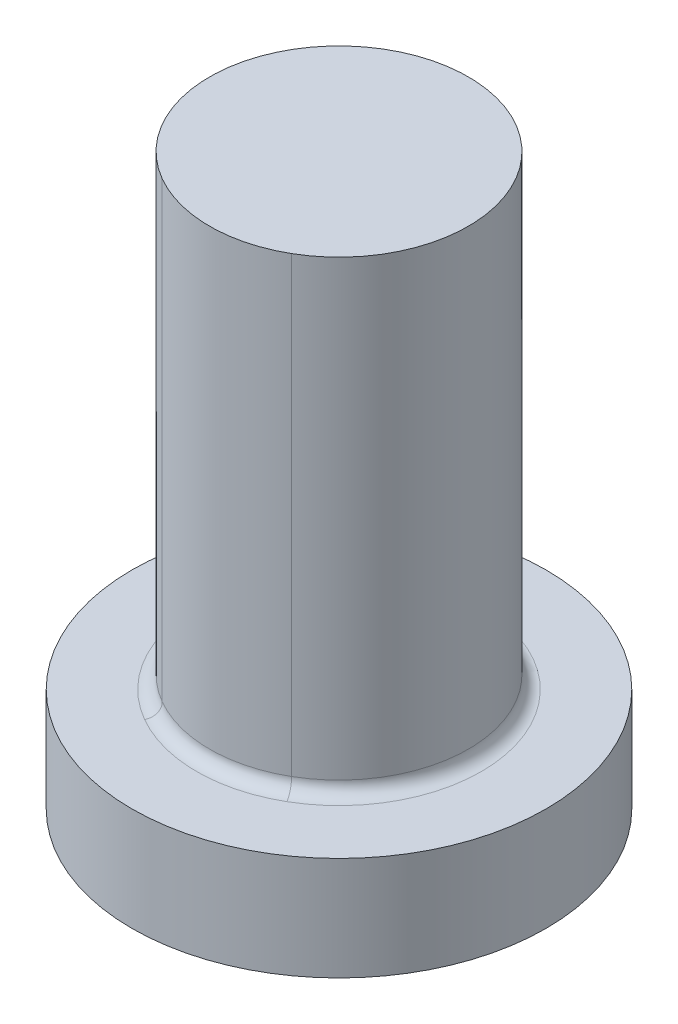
from build123d import *

# Parameters (mm, degrees)
CONG_1_R = 0.5


with BuildPart() as part:
    # Esquisse1 → R_volution1 (revolve)
    with BuildSketch(Plane.XY):
        Polygon((0, 0), (8, 0), (8, 4), (5, 4), (5, 22), (0, 22), align=None)
    revolve(axis=Axis((0, 0, 0), (0, 1, 0)))

    # Cong_1
    cong_1_edges = [part.edges().sort_by_distance(p)[0] for p in [
        (-5, 4, 0),
        (-5, 4, 0),
    ]]
    fillet(cong_1_edges, radius=CONG_1_R)


solid = part.part
